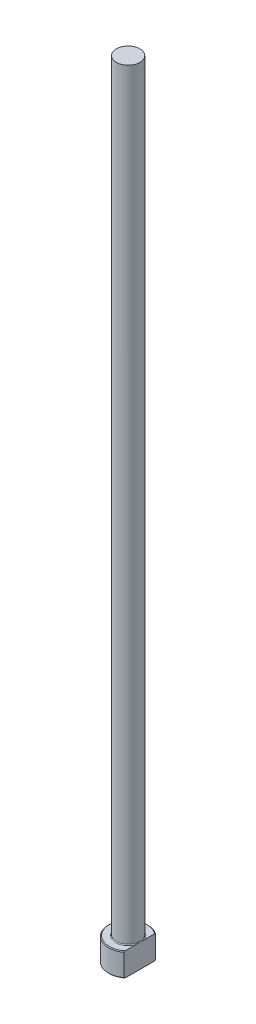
from build123d import *
from build123d.topology import SkipClean

# Parameters (mm, degrees)
CHAMFER1_SIZE    = 0.2
FILLET1_R        = 0.2
KEYED_HEAD_DEPTH = 201.124960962


with BuildPart() as part:
    # Sketch1 → Revolve1 (revolve)
    with BuildSketch(Plane.XY, mode=Mode.PRIVATE) as revolve1_sk:
        Polygon((0, 0), (-5, 0), (-5, 6), (-3, 6), (-3, 200), (0, 200), align=None)
    revolve(revolve1_sk.sketch.rotate(Axis((0, 259.958771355, 0), (0, -1, 0)), 270), axis=Axis((0, 259.958771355, 0), (0, -1, 0)))

    # Chamfer1
    chamfer1_edges = [part.edges().sort_by_distance(p)[0] for p in [
        (0, 6, -5),
        (0, 0, -5),
    ]]
    chamfer(chamfer1_edges, length=CHAMFER1_SIZE)

    # Fillet1
    fillet1_edges = [part.edges().sort_by_distance(p)[0] for p in [
        (0, 6, -3),
    ]]
    fillet(fillet1_edges, radius=FILLET1_R)

    # Sketch2 → KEYED HEAD (cut, through all)
    with SkipClean():  # the faces are left unmerged after this step: merging them gives an invalid solid
        with BuildSketch(Plane(origin=(0, 0, 0), x_dir=(1, 0, 0), z_dir=(0, 1, 0))):
            with BuildLine():
                Line((3, -4), (3, 4))
                ThreePointArc((3, 4), (5, 0), (3, -4))
            make_face()
        extrude(amount=KEYED_HEAD_DEPTH, mode=Mode.SUBTRACT)


solid = part.part
